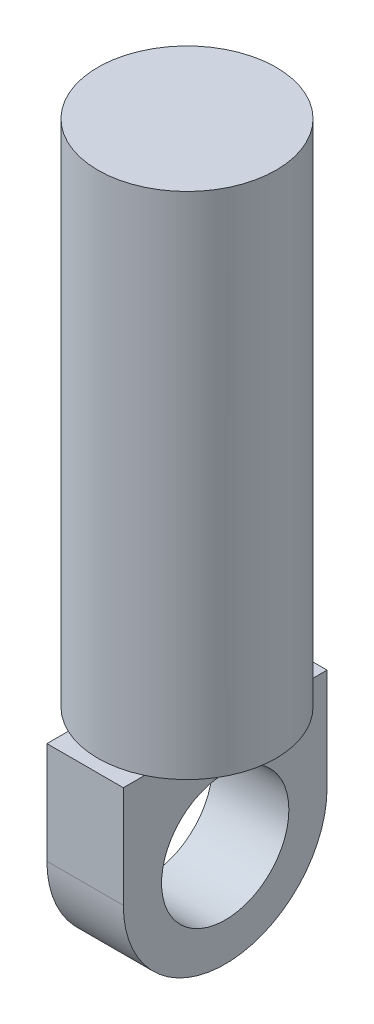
from build123d import *

# Parameters (mm, degrees)
SKETCH1_R           = 62.5
BOSS_EXTRUDE1_DEPTH = 37.5
SKETCH2_R           = 87.5
BOSS_EXTRUDE2_DEPTH = 500


with BuildPart() as part:
    # Sketch1 → Boss-Extrude1 (new, symmetric)
    with BuildSketch(Plane(origin=(0, 0, 0), x_dir=(0, 0, -1), z_dir=(1, 0, 0))):
        with BuildLine():
            Line((-100, 0), (-100, 100))
            Line((-100, 100), (100, 100))
            Line((100, 100), (100, 0))
            ThreePointArc((100, 0), (0, -100), (-100, 0))
        make_face()
        Circle(SKETCH1_R, mode=Mode.SUBTRACT)
    extrude(amount=BOSS_EXTRUDE1_DEPTH, both=True)

    # Sketch2 → Boss-Extrude2 (add)
    with BuildSketch(Plane(origin=(0, 100, 0), x_dir=(1, 0, 0), z_dir=(0, 1, 0))):
        with Locations(Location((0, 0, 0), (0, 0, 64.623066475))):
            Circle(SKETCH2_R)
    extrude(amount=BOSS_EXTRUDE2_DEPTH)


solid = part.part
